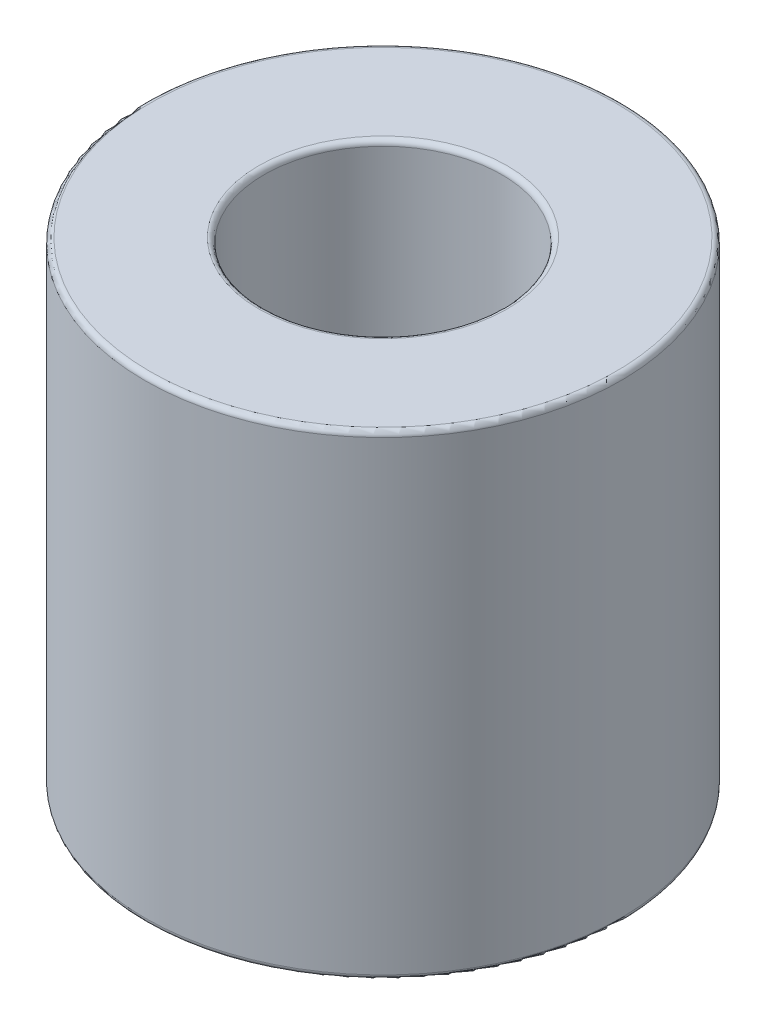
ISO-10303-21;
HEADER;
FILE_DESCRIPTION(('STEP AP214'),'2;1');
FILE_NAME('part.step','',(''),(''),'','','');
FILE_SCHEMA(('AUTOMOTIVE_DESIGN { 1 0 10303 214 1 1 1 1 }'));
ENDSEC;
DATA;
#1=APPLICATION_CONTEXT('core data for automotive mechanical design processes');
#2=APPLICATION_PROTOCOL_DEFINITION('international standard','automotive_design',2000,#1);
#3=PRODUCT_CONTEXT('',#1,'mechanical');
#4=PRODUCT('Part','Part','',(#3));
#5=PRODUCT_RELATED_PRODUCT_CATEGORY('part','',(#4));
#6=PRODUCT_DEFINITION_FORMATION('','',#4);
#7=PRODUCT_DEFINITION_CONTEXT('part definition',#1,'design');
#8=PRODUCT_DEFINITION('design','',#6,#7);
#9=PRODUCT_DEFINITION_SHAPE('','',#8);
#10=(LENGTH_UNIT() NAMED_UNIT(*) SI_UNIT(.MILLI.,.METRE.));
#11=(NAMED_UNIT(*) PLANE_ANGLE_UNIT() SI_UNIT($,.RADIAN.));
#12=(NAMED_UNIT(*) SI_UNIT($,.STERADIAN.) SOLID_ANGLE_UNIT());
#13=UNCERTAINTY_MEASURE_WITH_UNIT(LENGTH_MEASURE(1.E-05),#10,'distance_accuracy_value','');
#14=(GEOMETRIC_REPRESENTATION_CONTEXT(3) GLOBAL_UNCERTAINTY_ASSIGNED_CONTEXT((#13)) GLOBAL_UNIT_ASSIGNED_CONTEXT((#10,
#11,#12)) REPRESENTATION_CONTEXT('',''));
#15=CARTESIAN_POINT('',(0.,0.,0.));
#16=DIRECTION('',(0.,0.,1.));
#17=DIRECTION('',(1.,0.,0.));
#18=AXIS2_PLACEMENT_3D('',#15,#16,#17);
#19=CARTESIAN_POINT('',(0.,-3.175,0.));
#20=DIRECTION('',(0.,1.,0.));
#21=DIRECTION('',(0.,0.,1.));
#22=AXIS2_PLACEMENT_3D('',#19,#20,#21);
#23=CYLINDRICAL_SURFACE('',#22,3.175);
#24=CARTESIAN_POINT('',(0.,-3.10515,0.));
#25=DIRECTION('',(0.,1.,0.));
#26=DIRECTION('',(0.,0.,1.));
#27=AXIS2_PLACEMENT_3D('',#24,#25,#26);
#28=CIRCLE('',#27,3.175);
#29=CARTESIAN_POINT('',(0.,-3.10515,3.175));
#30=VERTEX_POINT('',#29);
#31=EDGE_CURVE('E56',#30,#30,#28,.T.);
#32=ORIENTED_EDGE('',*,*,#31,.T.);
#33=EDGE_LOOP('',(#32));
#34=FACE_BOUND('',#33,.T.);
#35=CARTESIAN_POINT('',(0.,3.10515,0.));
#36=DIRECTION('',(0.,1.,0.));
#37=DIRECTION('',(0.,0.,1.));
#38=AXIS2_PLACEMENT_3D('',#35,#36,#37);
#39=CIRCLE('',#38,3.175);
#40=CARTESIAN_POINT('',(0.,3.10515,3.175));
#41=VERTEX_POINT('',#40);
#42=EDGE_CURVE('E59',#41,#41,#39,.F.);
#43=ORIENTED_EDGE('',*,*,#42,.T.);
#44=EDGE_LOOP('',(#43));
#45=FACE_BOUND('',#44,.T.);
#46=ADVANCED_FACE('F30',(#34,#45),#23,.T.);
#47=CARTESIAN_POINT('',(0.,-3.175,0.));
#48=DIRECTION('',(0.,1.,0.));
#49=DIRECTION('',(0.,0.,1.));
#50=AXIS2_PLACEMENT_3D('',#47,#48,#49);
#51=PLANE('',#50);
#52=CARTESIAN_POINT('',(0.,-3.175,0.));
#53=DIRECTION('',(0.,1.,0.));
#54=DIRECTION('',(0.,0.,1.));
#55=AXIS2_PLACEMENT_3D('',#52,#53,#54);
#56=CIRCLE('',#55,3.10515);
#57=CARTESIAN_POINT('',(0.,-3.175,3.10515));
#58=VERTEX_POINT('',#57);
#59=EDGE_CURVE('E50',#58,#58,#56,.F.);
#60=ORIENTED_EDGE('',*,*,#59,.T.);
#61=EDGE_LOOP('',(#60));
#62=FACE_BOUND('',#61,.T.);
#63=CARTESIAN_POINT('',(0.,-3.175,0.));
#64=DIRECTION('',(0.,1.,0.));
#65=DIRECTION('',(0.,0.,1.));
#66=AXIS2_PLACEMENT_3D('',#63,#64,#65);
#67=CIRCLE('',#66,1.65735);
#68=CARTESIAN_POINT('',(0.,-3.175,1.65735));
#69=VERTEX_POINT('',#68);
#70=EDGE_CURVE('E53',#69,#69,#67,.T.);
#71=ORIENTED_EDGE('',*,*,#70,.T.);
#72=EDGE_LOOP('',(#71));
#73=FACE_BOUND('',#72,.T.);
#74=ADVANCED_FACE('F73',(#62,#73),#51,.F.);
#75=CARTESIAN_POINT('',(0.,-3.175,0.));
#76=DIRECTION('',(0.,1.,0.));
#77=DIRECTION('',(0.,0.,1.));
#78=AXIS2_PLACEMENT_3D('',#75,#76,#77);
#79=CYLINDRICAL_SURFACE('',#78,1.5875);
#80=CARTESIAN_POINT('',(0.,-3.10515,0.));
#81=DIRECTION('',(0.,1.,0.));
#82=DIRECTION('',(0.,0.,1.));
#83=AXIS2_PLACEMENT_3D('',#80,#81,#82);
#84=CIRCLE('',#83,1.5875);
#85=CARTESIAN_POINT('',(0.,-3.10515,1.5875));
#86=VERTEX_POINT('',#85);
#87=EDGE_CURVE('E41',#86,#86,#84,.F.);
#88=ORIENTED_EDGE('',*,*,#87,.T.);
#89=EDGE_LOOP('',(#88));
#90=FACE_BOUND('',#89,.T.);
#91=CARTESIAN_POINT('',(0.,3.10515,0.));
#92=DIRECTION('',(0.,1.,0.));
#93=DIRECTION('',(0.,0.,1.));
#94=AXIS2_PLACEMENT_3D('',#91,#92,#93);
#95=CIRCLE('',#94,1.5875);
#96=CARTESIAN_POINT('',(0.,3.10515,1.5875));
#97=VERTEX_POINT('',#96);
#98=EDGE_CURVE('E45',#97,#97,#95,.T.);
#99=ORIENTED_EDGE('',*,*,#98,.T.);
#100=EDGE_LOOP('',(#99));
#101=FACE_BOUND('',#100,.T.);
#102=ADVANCED_FACE('F79',(#90,#101),#79,.F.);
#103=CARTESIAN_POINT('',(0.,3.175,0.));
#104=DIRECTION('',(0.,1.,0.));
#105=DIRECTION('',(0.,0.,1.));
#106=AXIS2_PLACEMENT_3D('',#103,#104,#105);
#107=PLANE('',#106);
#108=CARTESIAN_POINT('',(0.,3.175,0.));
#109=DIRECTION('',(0.,1.,0.));
#110=DIRECTION('',(0.,0.,1.));
#111=AXIS2_PLACEMENT_3D('',#108,#109,#110);
#112=CIRCLE('',#111,1.65735);
#113=CARTESIAN_POINT('',(0.,3.175,1.65735));
#114=VERTEX_POINT('',#113);
#115=EDGE_CURVE('E10',#114,#114,#112,.F.);
#116=ORIENTED_EDGE('',*,*,#115,.T.);
#117=EDGE_LOOP('',(#116));
#118=FACE_BOUND('',#117,.T.);
#119=CARTESIAN_POINT('',(0.,3.175,0.));
#120=DIRECTION('',(0.,1.,0.));
#121=DIRECTION('',(0.,0.,1.));
#122=AXIS2_PLACEMENT_3D('',#119,#120,#121);
#123=CIRCLE('',#122,3.10515);
#124=CARTESIAN_POINT('',(0.,3.175,3.10515));
#125=VERTEX_POINT('',#124);
#126=EDGE_CURVE('E37',#125,#125,#123,.T.);
#127=ORIENTED_EDGE('',*,*,#126,.T.);
#128=EDGE_LOOP('',(#127));
#129=FACE_BOUND('',#128,.T.);
#130=ADVANCED_FACE('F87',(#118,#129),#107,.T.);
#131=CARTESIAN_POINT('',(0.,-3.10515,0.));
#132=DIRECTION('',(0.,1.,0.));
#133=DIRECTION('',(0.,0.,1.));
#134=AXIS2_PLACEMENT_3D('',#131,#132,#133);
#135=TOROIDAL_SURFACE('',#134,3.10515,0.06985);
#136=ORIENTED_EDGE('',*,*,#59,.F.);
#137=EDGE_LOOP('',(#136));
#138=FACE_BOUND('',#137,.T.);
#139=ORIENTED_EDGE('',*,*,#31,.F.);
#140=EDGE_LOOP('',(#139));
#141=FACE_BOUND('',#140,.T.);
#142=ADVANCED_FACE('F84',(#138,#141),#135,.T.);
#143=CARTESIAN_POINT('',(0.,-3.10515,0.));
#144=DIRECTION('',(0.,1.,0.));
#145=DIRECTION('',(0.,0.,1.));
#146=AXIS2_PLACEMENT_3D('',#143,#144,#145);
#147=TOROIDAL_SURFACE('',#146,1.65735,0.06985);
#148=ORIENTED_EDGE('',*,*,#87,.F.);
#149=EDGE_LOOP('',(#148));
#150=FACE_BOUND('',#149,.T.);
#151=ORIENTED_EDGE('',*,*,#70,.F.);
#152=EDGE_LOOP('',(#151));
#153=FACE_BOUND('',#152,.T.);
#154=ADVANCED_FACE('F70',(#150,#153),#147,.T.);
#155=CARTESIAN_POINT('',(0.,3.10515,0.));
#156=DIRECTION('',(0.,1.,0.));
#157=DIRECTION('',(0.,0.,1.));
#158=AXIS2_PLACEMENT_3D('',#155,#156,#157);
#159=TOROIDAL_SURFACE('',#158,1.65735,0.06985);
#160=ORIENTED_EDGE('',*,*,#115,.F.);
#161=EDGE_LOOP('',(#160));
#162=FACE_BOUND('',#161,.T.);
#163=ORIENTED_EDGE('',*,*,#98,.F.);
#164=EDGE_LOOP('',(#163));
#165=FACE_BOUND('',#164,.T.);
#166=ADVANCED_FACE('F66',(#162,#165),#159,.T.);
#167=CARTESIAN_POINT('',(0.,3.10515,0.));
#168=DIRECTION('',(0.,1.,0.));
#169=DIRECTION('',(0.,0.,1.));
#170=AXIS2_PLACEMENT_3D('',#167,#168,#169);
#171=TOROIDAL_SURFACE('',#170,3.10515,0.06985);
#172=ORIENTED_EDGE('',*,*,#42,.F.);
#173=EDGE_LOOP('',(#172));
#174=FACE_BOUND('',#173,.T.);
#175=ORIENTED_EDGE('',*,*,#126,.F.);
#176=EDGE_LOOP('',(#175));
#177=FACE_BOUND('',#176,.T.);
#178=ADVANCED_FACE('F32',(#174,#177),#171,.T.);
#179=CLOSED_SHELL('',(#46,#74,#102,#130,#142,#154,#166,#178));
#180=MANIFOLD_SOLID_BREP('B2',#179);
#181=ADVANCED_BREP_SHAPE_REPRESENTATION('',(#18,#180),#14);
#182=SHAPE_DEFINITION_REPRESENTATION(#9,#181);
ENDSEC;
END-ISO-10303-21;
